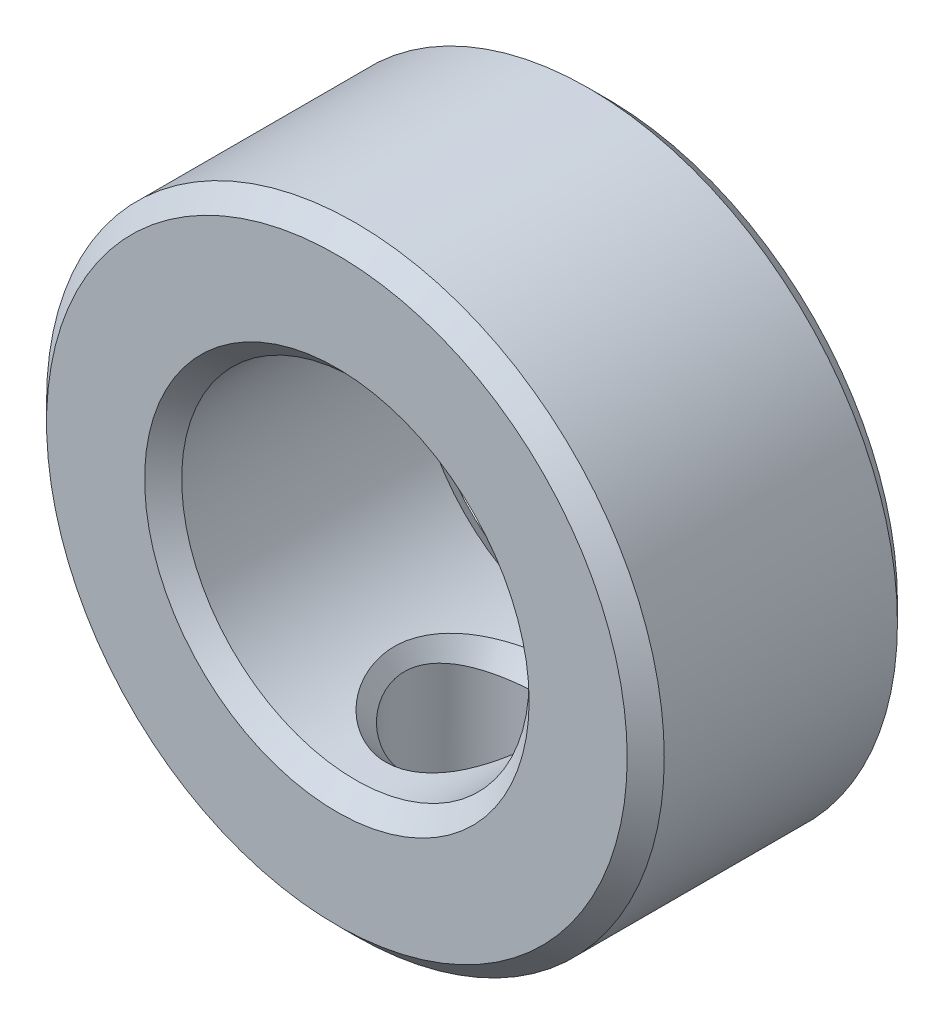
ISO-10303-21;
HEADER;
FILE_DESCRIPTION(('STEP AP214'),'2;1');
FILE_NAME('part.step','',(''),(''),'','','');
FILE_SCHEMA(('AUTOMOTIVE_DESIGN { 1 0 10303 214 1 1 1 1 }'));
ENDSEC;
DATA;
#1=APPLICATION_CONTEXT('core data for automotive mechanical design processes');
#2=APPLICATION_PROTOCOL_DEFINITION('international standard','automotive_design',2000,#1);
#3=PRODUCT_CONTEXT('',#1,'mechanical');
#4=PRODUCT('Part','Part','',(#3));
#5=PRODUCT_RELATED_PRODUCT_CATEGORY('part','',(#4));
#6=PRODUCT_DEFINITION_FORMATION('','',#4);
#7=PRODUCT_DEFINITION_CONTEXT('part definition',#1,'design');
#8=PRODUCT_DEFINITION('design','',#6,#7);
#9=PRODUCT_DEFINITION_SHAPE('','',#8);
#10=(LENGTH_UNIT() NAMED_UNIT(*) SI_UNIT(.MILLI.,.METRE.));
#11=(NAMED_UNIT(*) PLANE_ANGLE_UNIT() SI_UNIT($,.RADIAN.));
#12=(NAMED_UNIT(*) SI_UNIT($,.STERADIAN.) SOLID_ANGLE_UNIT());
#13=UNCERTAINTY_MEASURE_WITH_UNIT(LENGTH_MEASURE(1.E-05),#10,'distance_accuracy_value','');
#14=(GEOMETRIC_REPRESENTATION_CONTEXT(3) GLOBAL_UNCERTAINTY_ASSIGNED_CONTEXT((#13)) GLOBAL_UNIT_ASSIGNED_CONTEXT((#10,
#11,#12)) REPRESENTATION_CONTEXT('',''));
#15=CARTESIAN_POINT('',(0.,0.,0.));
#16=DIRECTION('',(0.,0.,1.));
#17=DIRECTION('',(1.,0.,0.));
#18=AXIS2_PLACEMENT_3D('',#15,#16,#17);
#19=CARTESIAN_POINT('',(0.,0.,5.55625));
#20=DIRECTION('',(0.,0.,1.));
#21=DIRECTION('',(1.,0.,0.));
#22=AXIS2_PLACEMENT_3D('',#19,#20,#21);
#23=PLANE('',#22);
#24=CARTESIAN_POINT('',(0.,0.,5.55625));
#25=DIRECTION('',(0.,0.,1.));
#26=DIRECTION('',(1.,0.,0.));
#27=AXIS2_PLACEMENT_3D('',#24,#25,#26);
#28=CIRCLE('',#27,7.90575);
#29=CARTESIAN_POINT('',(7.90575,0.,5.55625));
#30=VERTEX_POINT('',#29);
#31=EDGE_CURVE('E65',#30,#30,#28,.F.);
#32=ORIENTED_EDGE('',*,*,#31,.T.);
#33=EDGE_LOOP('',(#32));
#34=FACE_BOUND('',#33,.T.);
#35=CARTESIAN_POINT('',(0.,0.,5.55625));
#36=DIRECTION('',(0.,0.,1.));
#37=DIRECTION('',(1.,0.,0.));
#38=AXIS2_PLACEMENT_3D('',#35,#36,#37);
#39=CIRCLE('',#38,11.938);
#40=CARTESIAN_POINT('',(11.938,0.,5.55625));
#41=VERTEX_POINT('',#40);
#42=EDGE_CURVE('E135',#41,#41,#39,.T.);
#43=ORIENTED_EDGE('',*,*,#42,.T.);
#44=EDGE_LOOP('',(#43));
#45=FACE_BOUND('',#44,.T.);
#46=ADVANCED_FACE('F30',(#34,#45),#23,.T.);
#47=CARTESIAN_POINT('',(0.,0.,-5.55625));
#48=DIRECTION('',(0.,0.,1.));
#49=DIRECTION('',(1.,0.,0.));
#50=AXIS2_PLACEMENT_3D('',#47,#48,#49);
#51=PLANE('',#50);
#52=CARTESIAN_POINT('',(0.,0.,-5.55625));
#53=DIRECTION('',(0.,0.,1.));
#54=DIRECTION('',(1.,0.,0.));
#55=AXIS2_PLACEMENT_3D('',#52,#53,#54);
#56=CIRCLE('',#55,7.90575);
#57=CARTESIAN_POINT('',(7.90575,0.,-5.55625));
#58=VERTEX_POINT('',#57);
#59=EDGE_CURVE('E145',#58,#58,#56,.T.);
#60=ORIENTED_EDGE('',*,*,#59,.T.);
#61=EDGE_LOOP('',(#60));
#62=FACE_BOUND('',#61,.T.);
#63=CARTESIAN_POINT('',(0.,0.,-5.55625));
#64=DIRECTION('',(0.,0.,1.));
#65=DIRECTION('',(1.,0.,0.));
#66=AXIS2_PLACEMENT_3D('',#63,#64,#65);
#67=CIRCLE('',#66,11.938);
#68=CARTESIAN_POINT('',(11.938,0.,-5.55625));
#69=VERTEX_POINT('',#68);
#70=EDGE_CURVE('E148',#69,#69,#67,.F.);
#71=ORIENTED_EDGE('',*,*,#70,.T.);
#72=EDGE_LOOP('',(#71));
#73=FACE_BOUND('',#72,.T.);
#74=ADVANCED_FACE('F123',(#62,#73),#51,.F.);
#75=CARTESIAN_POINT('',(0.,0.,5.55625));
#76=DIRECTION('',(0.,0.,-1.));
#77=DIRECTION('',(-1.,0.,0.));
#78=AXIS2_PLACEMENT_3D('',#75,#76,#77);
#79=CYLINDRICAL_SURFACE('',#78,12.7);
#80=CARTESIAN_POINT('',(0.,-12.7,3.54012493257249));
#81=CARTESIAN_POINT('',(-0.0620983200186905,-12.7000092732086,3.54015884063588));
#82=CARTESIAN_POINT('',(-0.124194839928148,-12.6995073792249,3.5386876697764));
#83=CARTESIAN_POINT('',(-0.248096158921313,-12.6975321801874,3.53278375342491));
#84=CARTESIAN_POINT('',(-0.309901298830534,-12.6960609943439,3.52835746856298));
#85=CARTESIAN_POINT('',(-0.433091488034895,-12.6922012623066,3.51660238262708));
#86=CARTESIAN_POINT('',(-0.494477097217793,-12.6898143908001,3.50927887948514));
#87=CARTESIAN_POINT('',(-0.61670189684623,-12.6841777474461,3.4917893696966));
#88=CARTESIAN_POINT('',(-0.677541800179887,-12.6809293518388,3.4816278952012));
#89=CARTESIAN_POINT('',(-0.798548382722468,-12.6736238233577,3.45852168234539));
#90=CARTESIAN_POINT('',(-0.858715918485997,-12.6695678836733,3.44558104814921));
#91=CARTESIAN_POINT('',(-0.978251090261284,-12.66070136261,3.41697552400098));
#92=CARTESIAN_POINT('',(-1.03761975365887,-12.6558918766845,3.40131458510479));
#93=CARTESIAN_POINT('',(-1.15543042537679,-12.6455722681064,3.36732716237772));
#94=CARTESIAN_POINT('',(-1.21387368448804,-12.6400632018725,3.34900469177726));
#95=CARTESIAN_POINT('',(-1.32970673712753,-12.6283983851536,3.30975271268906));
#96=CARTESIAN_POINT('',(-1.38709807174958,-12.6222436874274,3.28882743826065));
#97=CARTESIAN_POINT('',(-1.50070038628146,-12.6093415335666,3.2444282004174));
#98=CARTESIAN_POINT('',(-1.55691326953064,-12.6025951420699,3.22095879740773));
#99=CARTESIAN_POINT('',(-1.66803171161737,-12.5885634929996,3.17152955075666));
#100=CARTESIAN_POINT('',(-1.72293960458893,-12.5812793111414,3.14557464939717));
#101=CARTESIAN_POINT('',(-1.83132103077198,-12.5662260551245,3.09123259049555));
#102=CARTESIAN_POINT('',(-1.8847973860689,-12.5584580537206,3.06285076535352));
#103=CARTESIAN_POINT('',(-1.99018861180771,-12.5424908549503,3.00371306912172));
#104=CARTESIAN_POINT('',(-2.042106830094,-12.5342927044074,2.97296288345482));
#105=CARTESIAN_POINT('',(-2.1442547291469,-12.5175200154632,2.90914658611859));
#106=CARTESIAN_POINT('',(-2.19448829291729,-12.5089464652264,2.87608643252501));
#107=CARTESIAN_POINT('',(-2.29313940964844,-12.491473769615,2.80770886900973));
#108=CARTESIAN_POINT('',(-2.34156135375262,-12.4825755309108,2.77239756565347));
#109=CARTESIAN_POINT('',(-2.43646332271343,-12.4645193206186,2.69957474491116));
#110=CARTESIAN_POINT('',(-2.48294816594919,-12.4553621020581,2.66206932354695));
#111=CARTESIAN_POINT('',(-2.57384440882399,-12.4367979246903,2.58492197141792));
#112=CARTESIAN_POINT('',(-2.61826093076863,-12.4273916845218,2.54528590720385));
#113=CARTESIAN_POINT('',(-2.70489331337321,-12.408550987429,2.4639329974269));
#114=CARTESIAN_POINT('',(-2.74711514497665,-12.3991166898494,2.42222247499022));
#115=CARTESIAN_POINT('',(-2.82929226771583,-12.3804489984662,2.33683743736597));
#116=CARTESIAN_POINT('',(-2.8692541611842,-12.3712150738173,2.29316939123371));
#117=CARTESIAN_POINT('',(-2.94684354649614,-12.3529652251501,2.20399539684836));
#118=CARTESIAN_POINT('',(-2.9844775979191,-12.3439487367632,2.15849527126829));
#119=CARTESIAN_POINT('',(-3.05734897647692,-12.3262063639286,2.06577655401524));
#120=CARTESIAN_POINT('',(-3.09259288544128,-12.3174797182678,2.01856328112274));
#121=CARTESIAN_POINT('',(-3.16062006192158,-12.3003748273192,1.92253931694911));
#122=CARTESIAN_POINT('',(-3.19340999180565,-12.2919956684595,1.87373350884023));
#123=CARTESIAN_POINT('',(-3.25646563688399,-12.275647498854,1.77464499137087));
#124=CARTESIAN_POINT('',(-3.28673811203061,-12.2676774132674,1.72436676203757));
#125=CARTESIAN_POINT('',(-3.34469514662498,-12.252208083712,1.62245401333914));
#126=CARTESIAN_POINT('',(-3.37238653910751,-12.2447076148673,1.5708235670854));
#127=CARTESIAN_POINT('',(-3.42511775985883,-12.2302384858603,1.46632696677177));
#128=CARTESIAN_POINT('',(-3.45016441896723,-12.2232684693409,1.41346444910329));
#129=CARTESIAN_POINT('',(-3.49754259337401,-12.2099211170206,1.30662432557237));
#130=CARTESIAN_POINT('',(-3.51988080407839,-12.2035423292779,1.2526498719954));
#131=CARTESIAN_POINT('',(-3.56177863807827,-12.1914382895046,1.14370653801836));
#132=CARTESIAN_POINT('',(-3.58134462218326,-12.1857115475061,1.08874027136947));
#133=CARTESIAN_POINT('',(-3.61763476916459,-12.174972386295,0.977934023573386));
#134=CARTESIAN_POINT('',(-3.63436468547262,-12.1699585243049,0.922096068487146));
#135=CARTESIAN_POINT('',(-3.66491971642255,-12.1607058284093,0.809667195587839));
#136=CARTESIAN_POINT('',(-3.67874962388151,-12.1564657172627,0.753077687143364));
#137=CARTESIAN_POINT('',(-3.70344211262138,-12.1488210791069,0.639266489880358));
#138=CARTESIAN_POINT('',(-3.71430808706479,-12.145415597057,0.58204560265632));
#139=CARTESIAN_POINT('',(-3.733010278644,-12.1395007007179,0.467092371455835));
#140=CARTESIAN_POINT('',(-3.74084796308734,-12.1369908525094,0.409360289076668));
#141=CARTESIAN_POINT('',(-3.75343300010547,-12.1329271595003,0.293505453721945));
#142=CARTESIAN_POINT('',(-3.75817928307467,-12.1313736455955,0.235382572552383));
#143=CARTESIAN_POINT('',(-3.76451663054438,-12.1292835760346,0.118866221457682));
#144=CARTESIAN_POINT('',(-3.76610339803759,-12.1287484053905,0.060472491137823));
#145=CARTESIAN_POINT('',(-3.76607599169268,-12.1287509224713,-0.0563137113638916));
#146=CARTESIAN_POINT('',(-3.76446182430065,-12.1292886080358,-0.114706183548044));
#147=CARTESIAN_POINT('',(-3.75809651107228,-12.1313769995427,-0.23121945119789));
#148=CARTESIAN_POINT('',(-3.75334969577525,-12.1329263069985,-0.289340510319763));
#149=CARTESIAN_POINT('',(-3.74078040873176,-12.136977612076,-0.40519213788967));
#150=CARTESIAN_POINT('',(-3.73295911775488,-12.1394792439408,-0.462922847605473));
#151=CARTESIAN_POINT('',(-3.7143063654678,-12.1453739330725,-0.577874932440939));
#152=CARTESIAN_POINT('',(-3.70347358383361,-12.1487673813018,-0.635096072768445));
#153=CARTESIAN_POINT('',(-3.67886137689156,-12.1563850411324,-0.748910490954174));
#154=CARTESIAN_POINT('',(-3.66507871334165,-12.1606101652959,-0.805503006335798));
#155=CARTESIAN_POINT('',(-3.63463004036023,-12.1698306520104,-0.91794173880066));
#156=CARTESIAN_POINT('',(-3.61795937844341,-12.1748272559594,-0.973786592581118));
#157=CARTESIAN_POINT('',(-3.58179741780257,-12.1855303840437,-1.08461161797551));
#158=CARTESIAN_POINT('',(-3.56230047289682,-12.1912383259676,-1.13958980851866));
#159=CARTESIAN_POINT('',(-3.52054827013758,-12.2033039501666,-1.24856311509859));
#160=CARTESIAN_POINT('',(-3.49828671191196,-12.2096631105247,-1.30255565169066));
#161=CARTESIAN_POINT('',(-3.45106726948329,-12.2229710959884,-1.40943922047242));
#162=CARTESIAN_POINT('',(-3.42610269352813,-12.2299213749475,-1.46232711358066));
#163=CARTESIAN_POINT('',(-3.37353895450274,-12.2443516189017,-1.56688291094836));
#164=CARTESIAN_POINT('',(-3.3459329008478,-12.2518329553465,-1.61854716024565));
#165=CARTESIAN_POINT('',(-3.28814774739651,-12.2672653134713,-1.72053713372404));
#166=CARTESIAN_POINT('',(-3.25796168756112,-12.2752175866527,-1.77085872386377));
#167=CARTESIAN_POINT('',(-3.19507798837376,-12.2915321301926,-1.87004478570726));
#168=CARTESIAN_POINT('',(-3.16237339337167,-12.2998955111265,-1.91890466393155));
#169=CARTESIAN_POINT('',(-3.09451383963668,-12.3169715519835,-2.0150487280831));
#170=CARTESIAN_POINT('',(-3.05935195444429,-12.3256851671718,-2.06232785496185));
#171=CARTESIAN_POINT('',(-2.98663969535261,-12.3434048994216,-2.15519167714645));
#172=CARTESIAN_POINT('',(-2.94908241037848,-12.3524118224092,-2.20077080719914));
#173=CARTESIAN_POINT('',(-2.87163868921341,-12.3706466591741,-2.29011656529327));
#174=CARTESIAN_POINT('',(-2.83174529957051,-12.3798751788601,-2.33387704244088));
#175=CARTESIAN_POINT('',(-2.7496983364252,-12.3985369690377,-2.41946514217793));
#176=CARTESIAN_POINT('',(-2.70753772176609,-12.4079708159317,-2.46128589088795));
#177=CARTESIAN_POINT('',(-2.62101284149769,-12.4268146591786,-2.54286109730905));
#178=CARTESIAN_POINT('',(-2.5766423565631,-12.4362244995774,-2.5826089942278));
#179=CARTESIAN_POINT('',(-2.485819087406,-12.4547980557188,-2.6599647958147));
#180=CARTESIAN_POINT('',(-2.43936113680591,-12.4639610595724,-2.6975668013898));
#181=CARTESIAN_POINT('',(-2.3444991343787,-12.4820308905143,-2.7705720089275));
#182=CARTESIAN_POINT('',(-2.29609021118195,-12.490936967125,-2.80596906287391));
#183=CARTESIAN_POINT('',(-2.19745269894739,-12.5084271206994,-2.87450754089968));
#184=CARTESIAN_POINT('',(-2.1472196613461,-12.5170102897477,-2.90764279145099));
#185=CARTESIAN_POINT('',(-2.04506278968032,-12.5338037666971,-2.9716000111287));
#186=CARTESIAN_POINT('',(-1.99313502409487,-12.5420130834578,-3.00241595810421));
#187=CARTESIAN_POINT('',(-1.88771680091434,-12.5580039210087,-3.06167689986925));
#188=CARTESIAN_POINT('',(-1.83422296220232,-12.5657843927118,-3.09011616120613));
#189=CARTESIAN_POINT('',(-1.72580085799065,-12.5808636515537,-3.14456587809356));
#190=CARTESIAN_POINT('',(-1.67086975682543,-12.5881613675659,-3.17057098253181));
#191=CARTESIAN_POINT('',(-1.55970135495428,-12.602220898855,-3.22009444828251));
#192=CARTESIAN_POINT('',(-1.50346172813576,-12.6089816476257,-3.24360789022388));
#193=CARTESIAN_POINT('',(-1.38980455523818,-12.6219130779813,-3.2880900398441));
#194=CARTESIAN_POINT('',(-1.33238513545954,-12.6280827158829,-3.30905426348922));
#195=CARTESIAN_POINT('',(-1.21649671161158,-12.6397777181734,-3.34837998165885));
#196=CARTESIAN_POINT('',(-1.15802621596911,-12.6453020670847,-3.36673738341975));
#197=CARTESIAN_POINT('',(-1.04016404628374,-12.6556522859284,-3.40079150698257));
#198=CARTESIAN_POINT('',(-0.980771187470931,-12.6604771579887,-3.41648443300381));
#199=CARTESIAN_POINT('',(-0.861192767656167,-12.6693742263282,-3.44515174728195));
#200=CARTESIAN_POINT('',(-0.80100625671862,-12.6734454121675,-3.45812248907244));
#201=CARTESIAN_POINT('',(-0.679969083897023,-12.6807809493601,-3.48128773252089));
#202=CARTESIAN_POINT('',(-0.619117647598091,-12.6840442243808,-3.49147853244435));
#203=CARTESIAN_POINT('',(-0.496879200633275,-12.6897098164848,-3.50902637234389));
#204=CARTESIAN_POINT('',(-0.435491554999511,-12.6921109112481,-3.51637939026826));
#205=CARTESIAN_POINT('',(-0.312309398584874,-12.6959981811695,-3.5281945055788));
#206=CARTESIAN_POINT('',(-0.250514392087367,-12.6974828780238,-3.53265193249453));
#207=CARTESIAN_POINT('',(-0.126645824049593,-12.699483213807,-3.53861869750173));
#208=CARTESIAN_POINT('',(-0.0645719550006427,-12.6999969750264,-3.54012232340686));
#209=CARTESIAN_POINT('',(0.0595840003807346,-12.7000025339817,-3.54012598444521));
#210=CARTESIAN_POINT('',(0.121666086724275,-12.6994941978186,-3.53862562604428));
#211=CARTESIAN_POINT('',(0.245566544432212,-12.6975064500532,-3.53266852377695));
#212=CARTESIAN_POINT('',(0.307385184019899,-12.6960286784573,-3.52821677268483));
#213=CARTESIAN_POINT('',(0.430628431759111,-12.6921563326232,-3.51641601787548));
#214=CARTESIAN_POINT('',(0.492053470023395,-12.6897630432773,-3.50907107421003));
#215=CARTESIAN_POINT('',(0.614378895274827,-12.684114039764,-3.4915429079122));
#216=CARTESIAN_POINT('',(0.675279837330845,-12.6808593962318,-3.48136320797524));
#217=CARTESIAN_POINT('',(0.796426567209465,-12.6735418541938,-3.45822403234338));
#218=CARTESIAN_POINT('',(0.856673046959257,-12.6694799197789,-3.44526787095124));
#219=CARTESIAN_POINT('',(0.976380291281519,-12.6606018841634,-3.41663397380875));
#220=CARTESIAN_POINT('',(1.03584193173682,-12.6557867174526,-3.40095960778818));
#221=CARTESIAN_POINT('',(1.15384888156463,-12.645456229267,-3.36694723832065));
#222=CARTESIAN_POINT('',(1.21239532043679,-12.6399418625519,-3.34861286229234));
#223=CARTESIAN_POINT('',(1.3284411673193,-12.6282669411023,-3.30933821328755));
#224=CARTESIAN_POINT('',(1.38594204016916,-12.6221073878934,-3.28840197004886));
#225=CARTESIAN_POINT('',(1.49976596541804,-12.6091960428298,-3.24398118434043));
#226=CARTESIAN_POINT('',(1.55609090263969,-12.6024453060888,-3.22050116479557));
#227=CARTESIAN_POINT('',(1.66743207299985,-12.5884055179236,-3.17105033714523));
#228=CARTESIAN_POINT('',(1.72245069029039,-12.581117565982,-3.14508458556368));
#229=CARTESIAN_POINT('',(1.83104826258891,-12.5660573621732,-3.09071975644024));
#230=CARTESIAN_POINT('',(1.88463016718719,-12.5582862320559,-3.06232626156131));
#231=CARTESIAN_POINT('',(1.99022325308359,-12.5423134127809,-3.00316344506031));
#232=CARTESIAN_POINT('',(2.04223799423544,-12.5341128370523,-2.97240017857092));
#233=CARTESIAN_POINT('',(2.14456577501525,-12.5173360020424,-2.90855525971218));
#234=CARTESIAN_POINT('',(2.19488299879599,-12.5087608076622,-2.87548003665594));
#235=CARTESIAN_POINT('',(2.29368427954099,-12.4912855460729,-2.80706915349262));
#236=CARTESIAN_POINT('',(2.34217311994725,-12.4823864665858,-2.77174015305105));
#237=CARTESIAN_POINT('',(2.43718796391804,-12.4643295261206,-2.69887827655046));
#238=CARTESIAN_POINT('',(2.48371926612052,-12.4551724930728,-2.66135210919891));
#239=CARTESIAN_POINT('',(2.57468289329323,-12.4366091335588,-2.58415832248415));
#240=CARTESIAN_POINT('',(2.61912090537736,-12.4272036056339,-2.54449721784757));
#241=CARTESIAN_POINT('',(2.70577510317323,-12.4083656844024,-2.46308565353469));
#242=CARTESIAN_POINT('',(2.74799760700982,-12.3989334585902,-2.42134188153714));
#243=CARTESIAN_POINT('',(2.83016525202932,-12.3802718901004,-2.33588182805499));
#244=CARTESIAN_POINT('',(2.87011702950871,-12.3710420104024,-2.29217204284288));
#245=CARTESIAN_POINT('',(2.94767658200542,-12.3528013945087,-2.20290758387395));
#246=CARTESIAN_POINT('',(2.98529091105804,-12.3437900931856,-2.15735871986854));
#247=CARTESIAN_POINT('',(3.05811532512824,-12.3260590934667,-2.06453784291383));
#248=CARTESIAN_POINT('',(3.09333195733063,-12.3173386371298,-2.01727111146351));
#249=CARTESIAN_POINT('',(3.16129889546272,-12.3002467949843,-1.92113762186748));
#250=CARTESIAN_POINT('',(3.1940558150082,-12.2918745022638,-1.87227570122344));
#251=CARTESIAN_POINT('',(3.25704163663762,-12.2755404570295,-1.77307446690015));
#252=CARTESIAN_POINT('',(3.28727725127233,-12.2675776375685,-1.72273959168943));
#253=CARTESIAN_POINT('',(3.34515861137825,-12.2521229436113,-1.62071514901));
#254=CARTESIAN_POINT('',(3.37281116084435,-12.2446298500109,-1.56902962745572));
#255=CARTESIAN_POINT('',(3.4254645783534,-12.2301752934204,-1.46442655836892));
#256=CARTESIAN_POINT('',(3.45047228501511,-12.2232124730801,-1.41151264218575));
#257=CARTESIAN_POINT('',(3.49777425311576,-12.2098790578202,-1.3045754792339));
#258=CARTESIAN_POINT('',(3.52007527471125,-12.2035069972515,-1.25055540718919));
#259=CARTESIAN_POINT('',(3.56190222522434,-12.1914156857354,-1.14152866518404));
#260=CARTESIAN_POINT('',(3.58143465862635,-12.1856949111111,-1.08652466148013));
#261=CARTESIAN_POINT('',(3.61766296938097,-12.174966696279,-0.975652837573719));
#262=CARTESIAN_POINT('',(3.63436484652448,-12.1699577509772,-0.919787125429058));
#263=CARTESIAN_POINT('',(3.6648708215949,-12.1607136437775,-0.807314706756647));
#264=CARTESIAN_POINT('',(3.67868008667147,-12.1564771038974,-0.750709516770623));
#265=CARTESIAN_POINT('',(3.70334000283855,-12.1488381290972,-0.636880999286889));
#266=CARTESIAN_POINT('',(3.71419457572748,-12.1454345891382,-0.579658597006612));
#267=CARTESIAN_POINT('',(3.7328844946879,-12.1395218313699,-0.464718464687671));
#268=CARTESIAN_POINT('',(3.74072201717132,-12.1370119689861,-0.407001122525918));
#269=CARTESIAN_POINT('',(3.75331847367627,-12.1329464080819,-0.291193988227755));
#270=CARTESIAN_POINT('',(3.75807725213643,-12.1313907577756,-0.233104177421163));
#271=CARTESIAN_POINT('',(3.76445468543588,-12.1292938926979,-0.116674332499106));
#272=CARTESIAN_POINT('',(3.7660701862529,-12.1287536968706,-0.0583341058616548));
#273=CARTESIAN_POINT('',(3.76611049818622,-12.1287452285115,0.0583342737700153));
#274=CARTESIAN_POINT('',(3.76453602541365,-12.1292767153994,0.116662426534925));
#275=CARTESIAN_POINT('',(3.7582534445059,-12.1313532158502,0.233046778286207));
#276=CARTESIAN_POINT('',(3.7535498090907,-12.1328967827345,0.291103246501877));
#277=CARTESIAN_POINT('',(3.74107035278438,-12.1369366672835,0.406825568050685));
#278=CARTESIAN_POINT('',(3.73329584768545,-12.1394325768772,0.464491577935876));
#279=CARTESIAN_POINT('',(3.71473811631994,-12.1453160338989,0.579314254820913));
#280=CARTESIAN_POINT('',(3.70395368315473,-12.1487039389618,0.636470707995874));
#281=CARTESIAN_POINT('',(3.67943819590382,-12.1563107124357,0.750155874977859));
#282=CARTESIAN_POINT('',(3.66570398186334,-12.1605304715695,0.806683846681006));
#283=CARTESIAN_POINT('',(3.635350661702,-12.1697404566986,0.918993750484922));
#284=CARTESIAN_POINT('',(3.61872693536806,-12.1747319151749,0.974774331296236));
#285=CARTESIAN_POINT('',(3.58265578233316,-12.1854249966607,1.08547121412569));
#286=CARTESIAN_POINT('',(3.56320268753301,-12.1911280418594,1.14038553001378));
#287=CARTESIAN_POINT('',(3.52153360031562,-12.2031841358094,1.24923164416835));
#288=CARTESIAN_POINT('',(3.49931122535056,-12.2095386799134,1.30316083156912));
#289=CARTESIAN_POINT('',(3.45216405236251,-12.2228377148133,1.4099184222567));
#290=CARTESIAN_POINT('',(3.42723241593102,-12.2297836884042,1.46274361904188));
#291=CARTESIAN_POINT('',(3.37472694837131,-12.24420562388,1.56717491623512));
#292=CARTESIAN_POINT('',(3.34714601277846,-12.251682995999,1.61877724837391));
#293=CARTESIAN_POINT('',(3.28940198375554,-12.2671077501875,1.72064446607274));
#294=CARTESIAN_POINT('',(3.25923164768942,-12.2750564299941,1.77090504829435));
#295=CARTESIAN_POINT('',(3.19636876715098,-12.2913641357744,1.86997035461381));
#296=CARTESIAN_POINT('',(3.16366891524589,-12.2997243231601,1.91877024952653));
#297=CARTESIAN_POINT('',(3.09580675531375,-12.3167943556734,2.01479585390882));
#298=CARTESIAN_POINT('',(3.06063710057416,-12.3255052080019,2.0620161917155));
#299=CARTESIAN_POINT('',(2.9878955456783,-12.3432198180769,2.15476399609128));
#300=CARTESIAN_POINT('',(2.95031624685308,-12.352224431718,2.20028549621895));
#301=CARTESIAN_POINT('',(2.87281382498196,-12.3704551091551,2.28951838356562));
#302=CARTESIAN_POINT('',(2.8328831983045,-12.3796818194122,2.33322312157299));
#303=CARTESIAN_POINT('',(2.7507433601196,-12.3983404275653,2.41870010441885));
#304=CARTESIAN_POINT('',(2.7085264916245,-12.407772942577,2.4604648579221));
#305=CARTESIAN_POINT('',(2.62187752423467,-12.4266147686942,2.54193721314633));
#306=CARTESIAN_POINT('',(2.57743855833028,-12.4360238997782,2.58163755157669));
#307=CARTESIAN_POINT('',(2.48647483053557,-12.4545971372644,2.65891577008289));
#308=CARTESIAN_POINT('',(2.43994435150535,-12.4637604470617,2.69648710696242));
#309=CARTESIAN_POINT('',(2.34493261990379,-12.4818318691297,2.76944470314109));
#310=CARTESIAN_POINT('',(2.29644606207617,-12.4907391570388,2.80482425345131));
#311=CARTESIAN_POINT('',(2.19765019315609,-12.5082326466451,2.87334060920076));
#312=CARTESIAN_POINT('',(2.1473361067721,-12.5168178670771,2.90647077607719));
#313=CARTESIAN_POINT('',(2.0450149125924,-12.5336162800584,2.97042906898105));
#314=CARTESIAN_POINT('',(1.99300363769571,-12.5418284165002,3.00125080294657));
#315=CARTESIAN_POINT('',(1.88741724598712,-12.5578256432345,3.06053312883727));
#316=CARTESIAN_POINT('',(1.83383859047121,-12.5656096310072,3.08898771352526));
#317=CARTESIAN_POINT('',(1.72524673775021,-12.5806965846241,3.14347639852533));
#318=CARTESIAN_POINT('',(1.67023061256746,-12.5879984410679,3.16950496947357));
#319=CARTESIAN_POINT('',(1.55889310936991,-12.6020668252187,3.21908221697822));
#320=CARTESIAN_POINT('',(1.50256936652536,-12.6088322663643,3.24262589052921));
#321=CARTESIAN_POINT('',(1.38874597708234,-12.6217735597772,3.28717387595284));
#322=CARTESIAN_POINT('',(1.33124446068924,-12.6279483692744,3.30817371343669));
#323=CARTESIAN_POINT('',(1.21519494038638,-12.6396540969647,3.34757455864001));
#324=CARTESIAN_POINT('',(1.15664548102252,-12.6451840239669,3.36597157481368));
#325=CARTESIAN_POINT('',(1.03862956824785,-12.6555456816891,3.40010735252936));
#326=CARTESIAN_POINT('',(0.979161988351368,-12.6603764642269,3.41584250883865));
#327=CARTESIAN_POINT('',(0.859439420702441,-12.6692855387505,3.4445952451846));
#328=CARTESIAN_POINT('',(0.799183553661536,-12.6733628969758,3.45760945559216));
#329=CARTESIAN_POINT('',(0.678014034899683,-12.6807108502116,3.48086110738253));
#330=CARTESIAN_POINT('',(0.617099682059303,-12.6839804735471,3.49109520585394));
#331=CARTESIAN_POINT('',(0.494743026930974,-12.6896587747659,3.50872773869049));
#332=CARTESIAN_POINT('',(0.433300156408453,-12.6920663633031,3.51612258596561));
#333=CARTESIAN_POINT('',(0.310015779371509,-12.6959663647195,3.52801767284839));
#334=CARTESIAN_POINT('',(0.24817382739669,-12.6974574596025,3.53251374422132));
#335=CARTESIAN_POINT('',(0.12422269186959,-12.6994708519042,3.53855388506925));
#336=CARTESIAN_POINT('',(0.0621132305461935,-12.69999145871,3.54009280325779));
#337=CARTESIAN_POINT('',(0.,-12.7,3.54012493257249));
#338=B_SPLINE_CURVE_WITH_KNOTS('',3,(#80,#81,#82,#83,#84,#85,#86,#87,#88,#89,#90,#91,#92,#93,
#94,#95,#96,#97,#98,#99,#100,#101,#102,#103,#104,#105,#106,#107,#108,#109,#110,#111,#112,#113,
#114,#115,#116,#117,#118,#119,#120,#121,#122,#123,#124,#125,#126,#127,#128,#129,#130,#131,#132,
#133,#134,#135,#136,#137,#138,#139,#140,#141,#142,#143,#144,#145,#146,#147,#148,#149,#150,#151,
#152,#153,#154,#155,#156,#157,#158,#159,#160,#161,#162,#163,#164,#165,#166,#167,#168,#169,#170,
#171,#172,#173,#174,#175,#176,#177,#178,#179,#180,#181,#182,#183,#184,#185,#186,#187,#188,#189,
#190,#191,#192,#193,#194,#195,#196,#197,#198,#199,#200,#201,#202,#203,#204,#205,#206,#207,#208,
#209,#210,#211,#212,#213,#214,#215,#216,#217,#218,#219,#220,#221,#222,#223,#224,#225,#226,#227,
#228,#229,#230,#231,#232,#233,#234,#235,#236,#237,#238,#239,#240,#241,#242,#243,#244,#245,#246,
#247,#248,#249,#250,#251,#252,#253,#254,#255,#256,#257,#258,#259,#260,#261,#262,#263,#264,#265,
#266,#267,#268,#269,#270,#271,#272,#273,#274,#275,#276,#277,#278,#279,#280,#281,#282,#283,#284,
#285,#286,#287,#288,#289,#290,#291,#292,#293,#294,#295,#296,#297,#298,#299,#300,#301,#302,#303,
#304,#305,#306,#307,#308,#309,#310,#311,#312,#313,#314,#315,#316,#317,#318,#319,#320,#321,#322,
#323,#324,#325,#326,#327,#328,#329,#330,#331,#332,#333,#334,#335,#336,#337),.UNSPECIFIED.,.F.,
.F.,(4,2,2,2,2,2,2,2,2,2,2,2,2,2,2,2,2,2,2,2,2,2,2,2,2,2,2,2,2,2,2,2,2,2,2,2,2,2,2,2,2,2,2,2,2,
2,2,2,2,2,2,2,2,2,2,2,2,2,2,2,2,2,2,2,2,2,2,2,2,2,2,2,2,2,2,2,2,2,2,2,2,2,2,2,2,2,2,2,2,2,2,2,2,
2,2,2,2,2,2,2,2,2,2,2,2,2,2,2,2,2,2,2,2,2,2,2,2,2,2,2,2,2,2,2,2,2,2,2,4),(0.,0.18627076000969,
0.372135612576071,0.557662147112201,0.742894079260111,0.927854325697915,1.1125481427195,
1.29696630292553,1.48108829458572,1.66488553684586,1.8483246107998,2.03137051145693,
2.21398992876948,2.39615456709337,2.57784451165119,2.75905164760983,2.93978313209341,
3.11999397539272,3.29964779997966,3.4787698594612,3.65737675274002,3.83547968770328,
4.01308779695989,4.19021150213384,4.36686592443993,4.54307433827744,4.71887166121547,
4.89430796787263,5.06945200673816,5.24439468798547,5.41925249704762,5.59417077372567,
5.76932678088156,5.94448243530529,6.11939646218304,6.29424337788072,6.46916707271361,
6.64428378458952,6.81968527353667,6.99544212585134,7.17160713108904,7.34821868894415,
7.52530421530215,7.70288352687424,7.88097219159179,8.05958483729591,8.23873841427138,
8.41845540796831,8.59876699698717,8.77961839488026,8.96094512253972,9.14275668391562,
9.32504614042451,9.5077936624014,9.69097002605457,9.87454005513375,10.0584660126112,
10.2427109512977,10.4272420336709,10.6120338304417,10.7970716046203,10.9823545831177,
11.1678992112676,11.3537423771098,11.539944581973,11.7261711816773,11.9120835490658,
12.0977359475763,12.2831586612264,12.4683612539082,12.6533358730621,12.838060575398,
13.0225026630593,13.2066220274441,13.390374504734,13.5737152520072,13.7566021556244,
13.9389992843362,14.1208803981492,14.3022325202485,14.4830595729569,14.663339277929,
14.8430617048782,15.022255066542,15.2009376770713,15.3791212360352,15.5568141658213,
15.734024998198,15.9107658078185,16.0870556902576,16.2629242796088,16.438415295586,
16.6135901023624,16.7885312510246,16.9633459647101,17.1381695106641,17.3131683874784,
17.4881279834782,17.6628380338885,17.8374733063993,18.0121787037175,18.1870721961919,
18.3622479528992,18.5377796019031,18.713723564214,18.8901224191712,19.0670082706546,
19.2444060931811,19.4223370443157,19.6008217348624,19.7798834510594,19.9595513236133,
20.1398634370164,20.3207721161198,20.5022095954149,20.6841774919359,20.8666609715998,
21.0496323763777,21.2330547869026,21.4168855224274,21.6010795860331,21.7855930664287,
21.9703865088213,22.1554282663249,22.3406978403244,22.5261892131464,22.711914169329,
22.8979055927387,23.0842207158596),.UNSPECIFIED.);
#339=CARTESIAN_POINT('',(0.,-12.7,3.54012493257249));
#340=VERTEX_POINT('',#339);
#341=EDGE_CURVE('E50',#340,#340,#338,.F.);
#342=ORIENTED_EDGE('',*,*,#341,.T.);
#343=EDGE_LOOP('',(#342));
#344=FACE_BOUND('',#343,.T.);
#345=CARTESIAN_POINT('',(0.,0.,-4.79425));
#346=DIRECTION('',(0.,0.,1.));
#347=DIRECTION('',(1.,0.,0.));
#348=AXIS2_PLACEMENT_3D('',#345,#346,#347);
#349=CIRCLE('',#348,12.7);
#350=CARTESIAN_POINT('',(12.7,0.,-4.79425));
#351=VERTEX_POINT('',#350);
#352=EDGE_CURVE('E55',#351,#351,#349,.T.);
#353=ORIENTED_EDGE('',*,*,#352,.T.);
#354=EDGE_LOOP('',(#353));
#355=FACE_BOUND('',#354,.T.);
#356=CARTESIAN_POINT('',(0.,0.,4.79425));
#357=DIRECTION('',(0.,0.,1.));
#358=DIRECTION('',(1.,0.,0.));
#359=AXIS2_PLACEMENT_3D('',#356,#357,#358);
#360=CIRCLE('',#359,12.7);
#361=CARTESIAN_POINT('',(12.7,0.,4.79425));
#362=VERTEX_POINT('',#361);
#363=EDGE_CURVE('E60',#362,#362,#360,.F.);
#364=ORIENTED_EDGE('',*,*,#363,.T.);
#365=EDGE_LOOP('',(#364));
#366=FACE_BOUND('',#365,.T.);
#367=ADVANCED_FACE('F32',(#344,#355,#366),#79,.T.);
#368=CARTESIAN_POINT('',(0.,0.,5.55625));
#369=DIRECTION('',(0.,0.,-1.));
#370=DIRECTION('',(-1.,0.,0.));
#371=AXIS2_PLACEMENT_3D('',#368,#369,#370);
#372=CYLINDRICAL_SURFACE('',#371,7.14375);
#373=CARTESIAN_POINT('',(0.,-7.14375,3.54012503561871));
#374=CARTESIAN_POINT('',(0.853464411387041,-7.14368585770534,3.53989345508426));
#375=CARTESIAN_POINT('',(1.67960289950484,-6.97386022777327,3.14772620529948));
#376=CARTESIAN_POINT('',(2.84562211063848,-6.57807671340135,1.85734335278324));
#377=CARTESIAN_POINT('',(3.20026053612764,-6.38690908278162,0.943498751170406));
#378=CARTESIAN_POINT('',(3.19755510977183,-6.38809037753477,-0.946661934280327));
#379=CARTESIAN_POINT('',(2.84530828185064,-6.57818170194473,-1.8563968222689));
#380=CARTESIAN_POINT('',(1.67928641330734,-6.97396569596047,-3.14937058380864));
#381=CARTESIAN_POINT('',(0.85097122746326,-7.14402308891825,-3.54077883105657));
#382=CARTESIAN_POINT('',(-0.856899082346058,-7.14347568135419,-3.53946820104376));
#383=CARTESIAN_POINT('',(-1.68028677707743,-6.97371844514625,-3.1483134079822));
#384=CARTESIAN_POINT('',(-2.84524711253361,-6.5781153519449,-1.85641410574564));
#385=CARTESIAN_POINT('',(-3.19945550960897,-6.38718390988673,-0.940790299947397));
#386=CARTESIAN_POINT('',(-3.19835758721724,-6.38781682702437,0.947857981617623));
#387=CARTESIAN_POINT('',(-2.84645858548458,-6.57770993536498,1.85557171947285));
#388=CARTESIAN_POINT('',(-1.6817468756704,-6.97323141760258,3.14619542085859));
#389=CARTESIAN_POINT('',(-0.853464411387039,-7.14381414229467,3.54035661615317));
#390=CARTESIAN_POINT('',(0.,-7.14375,3.54012503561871));
#391=B_SPLINE_CURVE_WITH_KNOTS('',3,(#373,#374,#375,#376,#377,#378,#379,#380,#381,#382,#383,
#384,#385,#386,#387,#388,#389,#390),.UNSPECIFIED.,.T.,.F.,(4,2,2,2,2,2,2,2,4),
(-7.32565808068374E-05,0.00273225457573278,0.00553776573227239,0.008343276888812,
0.0111487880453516,0.0139542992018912,0.0167598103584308,0.0195653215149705,0.0223708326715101),.UNSPECIFIED.);
#392=CARTESIAN_POINT('',(0.,-7.14375,3.54012503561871));
#393=VERTEX_POINT('',#392);
#394=EDGE_CURVE('E10',#393,#393,#391,.F.);
#395=ORIENTED_EDGE('',*,*,#394,.T.);
#396=EDGE_LOOP('',(#395));
#397=FACE_BOUND('',#396,.T.);
#398=CARTESIAN_POINT('',(0.,0.,-4.79425));
#399=DIRECTION('',(0.,0.,1.));
#400=DIRECTION('',(1.,0.,0.));
#401=AXIS2_PLACEMENT_3D('',#398,#399,#400);
#402=CIRCLE('',#401,7.14375);
#403=CARTESIAN_POINT('',(7.14375,0.,-4.79425));
#404=VERTEX_POINT('',#403);
#405=EDGE_CURVE('E137',#404,#404,#402,.F.);
#406=ORIENTED_EDGE('',*,*,#405,.T.);
#407=EDGE_LOOP('',(#406));
#408=FACE_BOUND('',#407,.T.);
#409=CARTESIAN_POINT('',(0.,0.,4.79425));
#410=DIRECTION('',(0.,0.,1.));
#411=DIRECTION('',(1.,0.,0.));
#412=AXIS2_PLACEMENT_3D('',#409,#410,#411);
#413=CIRCLE('',#412,7.14375);
#414=CARTESIAN_POINT('',(7.14375,0.,4.79425));
#415=VERTEX_POINT('',#414);
#416=EDGE_CURVE('E140',#415,#415,#413,.T.);
#417=ORIENTED_EDGE('',*,*,#416,.T.);
#418=EDGE_LOOP('',(#417));
#419=FACE_BOUND('',#418,.T.);
#420=ADVANCED_FACE('F118',(#397,#408,#419),#372,.F.);
#421=CARTESIAN_POINT('',(0.,0.,-5.55625));
#422=DIRECTION('',(0.,0.,-1.));
#423=DIRECTION('',(-1.,0.,0.));
#424=AXIS2_PLACEMENT_3D('',#421,#422,#423);
#425=CONICAL_SURFACE('',#424,7.90575,0.785398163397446);
#426=ORIENTED_EDGE('',*,*,#405,.F.);
#427=EDGE_LOOP('',(#426));
#428=FACE_BOUND('',#427,.T.);
#429=ORIENTED_EDGE('',*,*,#59,.F.);
#430=EDGE_LOOP('',(#429));
#431=FACE_BOUND('',#430,.T.);
#432=ADVANCED_FACE('F115',(#428,#431),#425,.F.);
#433=CARTESIAN_POINT('',(0.,0.,4.79425));
#434=DIRECTION('',(0.,0.,1.));
#435=DIRECTION('',(1.,0.,0.));
#436=AXIS2_PLACEMENT_3D('',#433,#434,#435);
#437=CONICAL_SURFACE('',#436,7.14375,0.785398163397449);
#438=ORIENTED_EDGE('',*,*,#31,.F.);
#439=EDGE_LOOP('',(#438));
#440=FACE_BOUND('',#439,.T.);
#441=ORIENTED_EDGE('',*,*,#416,.F.);
#442=EDGE_LOOP('',(#441));
#443=FACE_BOUND('',#442,.T.);
#444=ADVANCED_FACE('F111',(#440,#443),#437,.F.);
#445=CARTESIAN_POINT('',(0.,0.,-4.79425));
#446=DIRECTION('',(0.,0.,1.));
#447=DIRECTION('',(1.,0.,0.));
#448=AXIS2_PLACEMENT_3D('',#445,#446,#447);
#449=CONICAL_SURFACE('',#448,12.7,0.785398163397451);
#450=ORIENTED_EDGE('',*,*,#70,.F.);
#451=EDGE_LOOP('',(#450));
#452=FACE_BOUND('',#451,.T.);
#453=ORIENTED_EDGE('',*,*,#352,.F.);
#454=EDGE_LOOP('',(#453));
#455=FACE_BOUND('',#454,.T.);
#456=ADVANCED_FACE('F107',(#452,#455),#449,.T.);
#457=CARTESIAN_POINT('',(0.,0.,5.55625));
#458=DIRECTION('',(0.,0.,-1.));
#459=DIRECTION('',(-1.,0.,0.));
#460=AXIS2_PLACEMENT_3D('',#457,#458,#459);
#461=CONICAL_SURFACE('',#460,11.938,0.785398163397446);
#462=ORIENTED_EDGE('',*,*,#363,.F.);
#463=EDGE_LOOP('',(#462));
#464=FACE_BOUND('',#463,.T.);
#465=ORIENTED_EDGE('',*,*,#42,.F.);
#466=EDGE_LOOP('',(#465));
#467=FACE_BOUND('',#466,.T.);
#468=ADVANCED_FACE('F92',(#464,#467),#461,.T.);
#469=CARTESIAN_POINT('',(0.,-25.4,0.));
#470=DIRECTION('',(0.,1.,0.));
#471=DIRECTION('',(0.,0.,1.));
#472=AXIS2_PLACEMENT_3D('',#469,#470,#471);
#473=CYLINDRICAL_SURFACE('',#472,2.778125);
#474=CARTESIAN_POINT('',(0.,-11.9380000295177,2.77812500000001));
#475=CARTESIAN_POINT('',(0.733828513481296,-11.9378663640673,2.77771078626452));
#476=CARTESIAN_POINT('',(1.45468460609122,-11.8144297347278,2.47432597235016));
#477=CARTESIAN_POINT('',(2.47749037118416,-11.5298655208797,1.4512203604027));
#478=CARTESIAN_POINT('',(2.77834142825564,-11.4009674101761,0.733175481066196));
#479=CARTESIAN_POINT('',(2.77790857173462,-11.4010816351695,-0.733165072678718));
#480=CARTESIAN_POINT('',(2.47542575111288,-11.5304622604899,-1.45370476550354));
#481=CARTESIAN_POINT('',(1.45267747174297,-11.814946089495,-2.4759159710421));
#482=CARTESIAN_POINT('',(0.731614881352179,-11.9380387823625,-2.77814469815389));
#483=CARTESIAN_POINT('',(-0.735300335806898,-11.9379608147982,-2.77810407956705));
#484=CARTESIAN_POINT('',(-1.45474729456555,-11.8146346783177,-2.47568918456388));
#485=CARTESIAN_POINT('',(-2.47605028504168,-11.5300372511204,-1.45123638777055));
#486=CARTESIAN_POINT('',(-2.77792373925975,-11.4010563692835,-0.732343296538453));
#487=CARTESIAN_POINT('',(-2.77832530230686,-11.400993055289,0.735606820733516));
#488=CARTESIAN_POINT('',(-2.47469291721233,-11.5306151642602,1.45469029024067));
#489=CARTESIAN_POINT('',(-1.45212075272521,-11.8151454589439,2.47621907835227));
#490=CARTESIAN_POINT('',(-0.733828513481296,-11.9381336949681,2.77853921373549));
#491=CARTESIAN_POINT('',(0.,-11.9380000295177,2.77812500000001));
#492=B_SPLINE_CURVE_WITH_KNOTS('',3,(#474,#475,#476,#477,#478,#479,#480,#481,#482,#483,#484,
#485,#486,#487,#488,#489,#490,#491),.UNSPECIFIED.,.T.,.F.,(4,2,2,2,2,2,2,2,4),
(0.000991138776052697,0.003771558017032,0.0065519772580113,0.0093323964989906,
0.0121128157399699,0.0148932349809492,0.0176736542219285,0.0204540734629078,0.0232344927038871),.UNSPECIFIED.);
#493=CARTESIAN_POINT('',(0.,-11.9380000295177,2.77812500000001));
#494=VERTEX_POINT('',#493);
#495=EDGE_CURVE('E41',#494,#494,#492,.F.);
#496=ORIENTED_EDGE('',*,*,#495,.T.);
#497=EDGE_LOOP('',(#496));
#498=FACE_BOUND('',#497,.T.);
#499=CARTESIAN_POINT('',(0.,-7.90575005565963,2.778125));
#500=CARTESIAN_POINT('',(-0.0462545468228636,-7.90575603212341,2.77813877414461));
#501=CARTESIAN_POINT('',(-0.0925050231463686,-7.90502351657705,2.77694248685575));
#502=CARTESIAN_POINT('',(-0.184740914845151,-7.90215767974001,2.77218175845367));
#503=CARTESIAN_POINT('',(-0.230726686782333,-7.90002738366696,2.7686224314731));
#504=CARTESIAN_POINT('',(-0.322336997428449,-7.89444400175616,2.75919137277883));
#505=CARTESIAN_POINT('',(-0.367961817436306,-7.89099207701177,2.75332167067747));
#506=CARTESIAN_POINT('',(-0.458757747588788,-7.88284513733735,2.73932839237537));
#507=CARTESIAN_POINT('',(-0.503928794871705,-7.87814995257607,2.73120450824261));
#508=CARTESIAN_POINT('',(-0.593724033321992,-7.86759505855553,2.71275968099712));
#509=CARTESIAN_POINT('',(-0.638347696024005,-7.86173430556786,2.70243676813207));
#510=CARTESIAN_POINT('',(-0.726955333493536,-7.84892656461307,2.67965028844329));
#511=CARTESIAN_POINT('',(-0.770938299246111,-7.84197803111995,2.66718367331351));
#512=CARTESIAN_POINT('',(-0.858171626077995,-7.82707262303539,2.64016555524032));
#513=CARTESIAN_POINT('',(-0.901420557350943,-7.81911399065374,2.62561041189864));
#514=CARTESIAN_POINT('',(-0.987092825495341,-7.80226601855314,2.59447055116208));
#515=CARTESIAN_POINT('',(-1.029514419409,-7.79337492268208,2.57788199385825));
#516=CARTESIAN_POINT('',(-1.11343888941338,-7.77473946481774,2.54273023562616));
#517=CARTESIAN_POINT('',(-1.15493984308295,-7.76499349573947,2.52416330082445));
#518=CARTESIAN_POINT('',(-1.23692975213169,-7.74472557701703,2.48510943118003));
#519=CARTESIAN_POINT('',(-1.27741674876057,-7.73420226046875,2.4646190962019));
#520=CARTESIAN_POINT('',(-1.35728533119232,-7.7124569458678,2.42177283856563));
#521=CARTESIAN_POINT('',(-1.39666506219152,-7.70123386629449,2.39941400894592));
#522=CARTESIAN_POINT('',(-1.47422545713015,-7.67816594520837,2.35288507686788));
#523=CARTESIAN_POINT('',(-1.51240449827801,-7.66632031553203,2.32871266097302));
#524=CARTESIAN_POINT('',(-1.58747007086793,-7.64208550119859,2.27861057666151));
#525=CARTESIAN_POINT('',(-1.62435532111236,-7.62969580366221,2.25267923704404));
#526=CARTESIAN_POINT('',(-1.69673844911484,-7.60444626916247,2.19911402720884));
#527=CARTESIAN_POINT('',(-1.73223547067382,-7.59158615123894,2.17147913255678));
#528=CARTESIAN_POINT('',(-1.80175206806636,-7.56548722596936,2.11455874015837));
#529=CARTESIAN_POINT('',(-1.83577126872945,-7.55224832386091,2.08527282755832));
#530=CARTESIAN_POINT('',(-1.90222388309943,-7.52541615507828,2.02511278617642));
#531=CARTESIAN_POINT('',(-1.93465741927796,-7.51182291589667,1.99423878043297));
#532=CARTESIAN_POINT('',(-1.99790778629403,-7.48455308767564,1.93091662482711));
#533=CARTESIAN_POINT('',(-2.02872471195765,-7.47087650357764,1.89846856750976));
#534=CARTESIAN_POINT('',(-2.08875514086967,-7.44373136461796,1.83204417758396));
#535=CARTESIAN_POINT('',(-2.11796877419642,-7.43026279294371,1.79806796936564));
#536=CARTESIAN_POINT('',(-2.17472643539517,-7.40357893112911,1.72868144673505));
#537=CARTESIAN_POINT('',(-2.20227122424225,-7.39036352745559,1.69327179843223));
#538=CARTESIAN_POINT('',(-2.25564326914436,-7.36429845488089,1.62110196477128));
#539=CARTESIAN_POINT('',(-2.28147197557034,-7.35144848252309,1.58434296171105));
#540=CARTESIAN_POINT('',(-2.3313589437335,-7.32620882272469,1.50956085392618));
#541=CARTESIAN_POINT('',(-2.35541937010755,-7.31381858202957,1.47153938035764));
#542=CARTESIAN_POINT('',(-2.40171816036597,-7.28959782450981,1.39431807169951));
#543=CARTESIAN_POINT('',(-2.42395937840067,-7.27776644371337,1.35512021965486));
#544=CARTESIAN_POINT('',(-2.46656780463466,-7.2547616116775,1.27563219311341));
#545=CARTESIAN_POINT('',(-2.48693848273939,-7.24358695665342,1.23534422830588));
#546=CARTESIAN_POINT('',(-2.5257540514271,-7.22199415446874,1.15376208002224));
#547=CARTESIAN_POINT('',(-2.54420289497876,-7.21157446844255,1.11247018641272));
#548=CARTESIAN_POINT('',(-2.57912312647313,-7.19159007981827,1.02896644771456));
#549=CARTESIAN_POINT('',(-2.59559875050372,-7.18202355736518,0.986756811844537));
#550=CARTESIAN_POINT('',(-2.62652108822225,-7.16384393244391,0.90150398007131));
#551=CARTESIAN_POINT('',(-2.64097204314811,-7.15522884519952,0.858462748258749));
#552=CARTESIAN_POINT('',(-2.6677938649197,-7.13905039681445,0.771633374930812));
#553=CARTESIAN_POINT('',(-2.68016861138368,-7.13148507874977,0.72784679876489));
#554=CARTESIAN_POINT('',(-2.70278723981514,-7.11750425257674,0.639613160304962));
#555=CARTESIAN_POINT('',(-2.7130341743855,-7.11108709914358,0.595167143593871));
#556=CARTESIAN_POINT('',(-2.73134679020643,-7.09950044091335,0.505702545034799));
#557=CARTESIAN_POINT('',(-2.73941412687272,-7.0943299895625,0.460684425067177));
#558=CARTESIAN_POINT('',(-2.75331807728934,-7.08533394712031,0.370158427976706));
#559=CARTESIAN_POINT('',(-2.75915427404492,-7.08150860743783,0.324650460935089));
#560=CARTESIAN_POINT('',(-2.76619533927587,-7.07685412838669,0.256123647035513));
#561=CARTESIAN_POINT('',(-2.76825742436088,-7.07548280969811,0.233225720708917));
#562=CARTESIAN_POINT('',(-2.7718055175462,-7.07311268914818,0.18734046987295));
#563=CARTESIAN_POINT('',(-2.77329090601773,-7.07211428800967,0.164353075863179));
#564=CARTESIAN_POINT('',(-2.7756789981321,-7.0705023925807,0.118300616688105));
#565=CARTESIAN_POINT('',(-2.77658083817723,-7.0698894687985,0.0952354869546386));
#566=CARTESIAN_POINT('',(-2.77779668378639,-7.0690599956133,0.04903809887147));
#567=CARTESIAN_POINT('',(-2.77810955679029,-7.06884420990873,0.0259057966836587));
#568=CARTESIAN_POINT('',(-2.77813767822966,-7.06882336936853,-0.0203648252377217));
#569=CARTESIAN_POINT('',(-2.77785278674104,-7.0690184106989,-0.0435031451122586));
#570=CARTESIAN_POINT('',(-2.77668616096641,-7.06981059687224,-0.0897239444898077));
#571=CARTESIAN_POINT('',(-2.77580529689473,-7.07040715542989,-0.112806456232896));
#572=CARTESIAN_POINT('',(-2.77345464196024,-7.07198914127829,-0.158904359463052));
#573=CARTESIAN_POINT('',(-2.77198545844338,-7.0729741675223,-0.181919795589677));
#574=CARTESIAN_POINT('',(-2.76846502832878,-7.0753205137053,-0.227871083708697));
#575=CARTESIAN_POINT('',(-2.76641415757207,-7.07668159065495,-0.250806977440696));
#576=CARTESIAN_POINT('',(-2.75939888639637,-7.08131031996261,-0.31947478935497));
#577=CARTESIAN_POINT('',(-2.75357085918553,-7.08512413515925,-0.365085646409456));
#578=CARTESIAN_POINT('',(-2.73966900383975,-7.09410616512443,-0.45584863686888));
#579=CARTESIAN_POINT('',(-2.73159401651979,-7.09927507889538,-0.501000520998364));
#580=CARTESIAN_POINT('',(-2.71325396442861,-7.11086646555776,-0.590758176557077));
#581=CARTESIAN_POINT('',(-2.70298596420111,-7.11729061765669,-0.635363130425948));
#582=CARTESIAN_POINT('',(-2.68031512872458,-7.13129202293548,-0.723934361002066));
#583=CARTESIAN_POINT('',(-2.66790827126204,-7.1388714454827,-0.767899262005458));
#584=CARTESIAN_POINT('',(-2.64101420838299,-7.15508344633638,-0.855099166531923));
#585=CARTESIAN_POINT('',(-2.62652246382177,-7.16371831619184,-0.898332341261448));
#586=CARTESIAN_POINT('',(-2.59551258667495,-7.18194159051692,-0.98397705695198));
#587=CARTESIAN_POINT('',(-2.57898985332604,-7.19153215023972,-1.02638647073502));
#588=CARTESIAN_POINT('',(-2.54397151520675,-7.2115674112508,-1.11029184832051));
#589=CARTESIAN_POINT('',(-2.52547159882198,-7.22201396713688,-1.15178556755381));
#590=CARTESIAN_POINT('',(-2.4865520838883,-7.2436619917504,-1.23376750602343));
#591=CARTESIAN_POINT('',(-2.46612872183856,-7.25486492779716,-1.27425354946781));
#592=CARTESIAN_POINT('',(-2.42341523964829,-7.27792645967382,-1.35412791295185));
#593=CARTESIAN_POINT('',(-2.40112208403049,-7.28978611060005,-1.39351430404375));
#594=CARTESIAN_POINT('',(-2.35472183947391,-7.31406217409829,-1.47109687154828));
#595=CARTESIAN_POINT('',(-2.33061255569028,-7.32647925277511,-1.50929152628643));
#596=CARTESIAN_POINT('',(-2.28063250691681,-7.35176995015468,-1.58439824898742));
#597=CARTESIAN_POINT('',(-2.25476044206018,-7.36464390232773,-1.62130933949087));
#598=CARTESIAN_POINT('',(-2.20130822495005,-7.39075288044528,-1.69375534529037));
#599=CARTESIAN_POINT('',(-2.17372767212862,-7.40398799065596,-1.72928993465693));
#600=CARTESIAN_POINT('',(-2.11690815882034,-7.43070573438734,-1.79889324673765));
#601=CARTESIAN_POINT('',(-2.08766965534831,-7.44418829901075,-1.83296236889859));
#602=CARTESIAN_POINT('',(-2.02759780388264,-7.47135445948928,-1.89953002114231));
#603=CARTESIAN_POINT('',(-1.99676567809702,-7.48503789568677,-1.93202971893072));
#604=CARTESIAN_POINT('',(-1.9335069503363,-7.5123138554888,-1.99542121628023));
#605=CARTESIAN_POINT('',(-1.90108166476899,-7.52590644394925,-2.02631430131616));
#606=CARTESIAN_POINT('',(-1.83467653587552,-7.5527307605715,-2.08649453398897));
#607=CARTESIAN_POINT('',(-1.80069780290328,-7.5659627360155,-2.1157827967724));
#608=CARTESIAN_POINT('',(-1.73128547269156,-7.59204223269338,-2.17268939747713));
#609=CARTESIAN_POINT('',(-1.69585325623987,-7.60489009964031,-2.20030926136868));
#610=CARTESIAN_POINT('',(-1.62361982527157,-7.63011068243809,-2.25382988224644));
#611=CARTESIAN_POINT('',(-1.58682026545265,-7.64248393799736,-2.27973261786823));
#612=CARTESIAN_POINT('',(-1.51194171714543,-7.66668250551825,-2.32976575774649));
#613=CARTESIAN_POINT('',(-1.47386461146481,-7.67850856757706,-2.35389861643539));
#614=CARTESIAN_POINT('',(-1.39651959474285,-7.70153511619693,-2.40033982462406));
#615=CARTESIAN_POINT('',(-1.35725372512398,-7.71273659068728,-2.42265108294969));
#616=CARTESIAN_POINT('',(-1.27762013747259,-7.73443759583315,-2.46539664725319));
#617=CARTESIAN_POINT('',(-1.2372545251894,-7.74493835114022,-2.48583425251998));
#618=CARTESIAN_POINT('',(-1.15551043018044,-7.76516120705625,-2.52478020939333));
#619=CARTESIAN_POINT('',(-1.11413400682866,-7.77488474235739,-2.54329213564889));
#620=CARTESIAN_POINT('',(-1.03045739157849,-7.79347657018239,-2.57833453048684));
#621=CARTESIAN_POINT('',(-0.988159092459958,-7.80234644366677,-2.59486867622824));
#622=CARTESIAN_POINT('',(-0.902727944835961,-7.81915440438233,-2.62590348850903));
#623=CARTESIAN_POINT('',(-0.859596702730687,-7.82709411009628,-2.64040769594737));
#624=CARTESIAN_POINT('',(-0.772588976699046,-7.84196531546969,-2.66733085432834));
#625=CARTESIAN_POINT('',(-0.728713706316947,-7.84889830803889,-2.67975289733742));
#626=CARTESIAN_POINT('',(-0.640307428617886,-7.86167983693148,-2.70246026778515));
#627=CARTESIAN_POINT('',(-0.595777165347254,-7.8675295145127,-2.71274784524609));
#628=CARTESIAN_POINT('',(-0.506150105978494,-7.87806840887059,-2.73113523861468));
#629=CARTESIAN_POINT('',(-0.461053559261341,-7.88275811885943,-2.73923598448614));
#630=CARTESIAN_POINT('',(-0.370384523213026,-7.89090135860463,-2.75319911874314));
#631=CARTESIAN_POINT('',(-0.324811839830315,-7.89435436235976,-2.7590605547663));
#632=CARTESIAN_POINT('',(-0.233275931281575,-7.89994895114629,-2.76849519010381));
#633=CARTESIAN_POINT('',(-0.187312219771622,-7.90208854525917,-2.77206491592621));
#634=CARTESIAN_POINT('',(-0.118203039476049,-7.90425642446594,-2.77566334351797));
#635=CARTESIAN_POINT('',(-0.0951155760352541,-7.90480549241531,-2.77657015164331));
#636=CARTESIAN_POINT('',(-0.0488768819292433,-7.90554769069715,-2.77779305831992));
#637=CARTESIAN_POINT('',(-0.0257256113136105,-7.90574017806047,-2.77810808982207));
#638=CARTESIAN_POINT('',(0.0205810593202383,-7.90575857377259,-2.7781395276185));
#639=CARTESIAN_POINT('',(0.0437364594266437,-7.90558442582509,-2.77785584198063));
#640=CARTESIAN_POINT('',(0.0899912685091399,-7.90487678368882,-2.77669285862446));
#641=CARTESIAN_POINT('',(0.113090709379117,-7.90434382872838,-2.77581445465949));
#642=CARTESIAN_POINT('',(0.182256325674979,-7.90222172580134,-2.77229773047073));
#643=CARTESIAN_POINT('',(0.228265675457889,-7.90010931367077,-2.76877791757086));
#644=CARTESIAN_POINT('',(0.319918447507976,-7.8945635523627,-2.75943565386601));
#645=CARTESIAN_POINT('',(0.365562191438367,-7.89113153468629,-2.75361552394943));
#646=CARTESIAN_POINT('',(0.456395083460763,-7.88302529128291,-2.73972800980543));
#647=CARTESIAN_POINT('',(0.501584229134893,-7.87835105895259,-2.73166061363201));
#648=CARTESIAN_POINT('',(0.591414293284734,-7.86783855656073,-2.71333318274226));
#649=CARTESIAN_POINT('',(0.63605475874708,-7.86199938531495,-2.70307145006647));
#650=CARTESIAN_POINT('',(0.724695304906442,-7.84923476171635,-2.68040933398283));
#651=CARTESIAN_POINT('',(0.768694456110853,-7.84230787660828,-2.66800612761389));
#652=CARTESIAN_POINT('',(0.855959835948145,-7.82744523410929,-2.64111449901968));
#653=CARTESIAN_POINT('',(0.899224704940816,-7.81950779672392,-2.62662259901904));
#654=CARTESIAN_POINT('',(0.984929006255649,-7.80270119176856,-2.59560656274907));
#655=CARTESIAN_POINT('',(1.02736674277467,-7.7938303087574,-2.57907867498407));
#656=CARTESIAN_POINT('',(1.11132412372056,-7.77523376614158,-2.54404327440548));
#657=CARTESIAN_POINT('',(1.15284185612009,-7.76550650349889,-2.52553203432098));
#658=CARTESIAN_POINT('',(1.23486643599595,-7.74527399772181,-2.48658225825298));
#659=CARTESIAN_POINT('',(1.27537128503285,-7.73476735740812,-2.46614024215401));
#660=CARTESIAN_POINT('',(1.35527718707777,-7.7130529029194,-2.42338101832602));
#661=CARTESIAN_POINT('',(1.39467628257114,-7.70184394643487,-2.40106073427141));
#662=CARTESIAN_POINT('',(1.4722775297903,-7.67880128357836,-2.35459697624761));
#663=CARTESIAN_POINT('',(1.51047788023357,-7.66696670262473,-2.33045092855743));
#664=CARTESIAN_POINT('',(1.58558874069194,-7.64275049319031,-2.28038737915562));
#665=CARTESIAN_POINT('',(1.62249770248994,-7.63036824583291,-2.25446785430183));
#666=CARTESIAN_POINT('',(1.6949313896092,-7.60512962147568,-2.20090968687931));
#667=CARTESIAN_POINT('',(1.73045488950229,-7.59227284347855,-2.17326957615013));
#668=CARTESIAN_POINT('',(1.80002840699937,-7.56617606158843,-2.11632015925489));
#669=CARTESIAN_POINT('',(1.83407756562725,-7.55293584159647,-2.08700990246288));
#670=CARTESIAN_POINT('',(1.90059359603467,-7.5260960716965,-2.02677916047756));
#671=CARTESIAN_POINT('',(1.93305996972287,-7.51249641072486,-1.99585817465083));
#672=CARTESIAN_POINT('',(1.99637737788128,-7.48521085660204,-1.93242849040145));
#673=CARTESIAN_POINT('',(2.0272281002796,-7.47152494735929,-1.89991948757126));
#674=CARTESIAN_POINT('',(2.08732529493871,-7.44436052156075,-1.83336980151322));
#675=CARTESIAN_POINT('',(2.11657179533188,-7.43088200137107,-1.79932914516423));
#676=CARTESIAN_POINT('',(2.17339361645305,-7.40417765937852,-1.72981004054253));
#677=CARTESIAN_POINT('',(2.20096959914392,-7.39095173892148,-1.69433217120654));
#678=CARTESIAN_POINT('',(2.25440306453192,-7.36486502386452,-1.62202329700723));
#679=CARTESIAN_POINT('',(2.2802619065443,-7.352003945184,-1.58519339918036));
#680=CARTESIAN_POINT('',(2.33020841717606,-7.32674145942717,-1.51026762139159));
#681=CARTESIAN_POINT('',(2.3542981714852,-7.31433951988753,-1.47217331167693));
#682=CARTESIAN_POINT('',(2.40065522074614,-7.29009474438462,-1.39480526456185));
#683=CARTESIAN_POINT('',(2.42292530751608,-7.27825106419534,-1.35553346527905));
#684=CARTESIAN_POINT('',(2.46559137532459,-7.25522101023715,-1.2758972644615));
#685=CARTESIAN_POINT('',(2.48599078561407,-7.2440334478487,-1.2355350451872));
#686=CARTESIAN_POINT('',(2.52486402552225,-7.22241420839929,-1.15380490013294));
#687=CARTESIAN_POINT('',(2.5433417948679,-7.21198099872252,-1.11243925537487));
#688=CARTESIAN_POINT('',(2.57832037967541,-7.19196894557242,-1.02878931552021));
#689=CARTESIAN_POINT('',(2.59482545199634,-7.18238827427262,-0.986507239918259));
#690=CARTESIAN_POINT('',(2.62580747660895,-7.16417974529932,-0.901111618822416));
#691=CARTESIAN_POINT('',(2.64028873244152,-7.15554987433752,-0.85800006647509));
#692=CARTESIAN_POINT('',(2.66717222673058,-7.13934126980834,-0.771032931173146));
#693=CARTESIAN_POINT('',(2.67957845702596,-7.1317605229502,-0.727178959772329));
#694=CARTESIAN_POINT('',(2.70226139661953,-7.11774827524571,-0.638814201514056));
#695=CARTESIAN_POINT('',(2.71254132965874,-7.11131503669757,-0.594304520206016));
#696=CARTESIAN_POINT('',(2.73092154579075,-7.09969567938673,-0.504717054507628));
#697=CARTESIAN_POINT('',(2.73902372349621,-7.09450847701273,-0.459639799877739));
#698=CARTESIAN_POINT('',(2.75299922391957,-7.08547844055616,-0.36900080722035));
#699=CARTESIAN_POINT('',(2.75887244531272,-7.08163566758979,-0.323439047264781));
#700=CARTESIAN_POINT('',(2.76597089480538,-7.07695452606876,-0.254833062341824));
#701=CARTESIAN_POINT('',(2.76805234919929,-7.0755742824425,-0.231910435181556));
#702=CARTESIAN_POINT('',(2.77163980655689,-7.07318617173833,-0.185977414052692));
#703=CARTESIAN_POINT('',(2.77314524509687,-7.07217866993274,-0.162966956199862));
#704=CARTESIAN_POINT('',(2.77557397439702,-7.07054849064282,-0.116870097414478));
#705=CARTESIAN_POINT('',(2.77649646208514,-7.06992634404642,-0.0937836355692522));
#706=CARTESIAN_POINT('',(2.77775464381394,-7.06907813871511,-0.0475454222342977));
#707=CARTESIAN_POINT('',(2.77808927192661,-7.06885279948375,-0.0243936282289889));
#708=CARTESIAN_POINT('',(2.7781601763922,-7.06881336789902,0.0219131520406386));
#709=CARTESIAN_POINT('',(2.77789640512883,-7.06899930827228,0.0450681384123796));
#710=CARTESIAN_POINT('',(2.77676949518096,-7.06977459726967,0.0913185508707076));
#711=CARTESIAN_POINT('',(2.77590734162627,-7.07036328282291,0.114414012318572));
#712=CARTESIAN_POINT('',(2.77359212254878,-7.07193056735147,0.160534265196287));
#713=CARTESIAN_POINT('',(2.77213976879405,-7.07290869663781,0.183559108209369));
#714=CARTESIAN_POINT('',(2.76865096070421,-7.07524229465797,0.229525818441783));
#715=CARTESIAN_POINT('',(2.76661497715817,-7.07659745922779,0.252467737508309));
#716=CARTESIAN_POINT('',(2.75964192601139,-7.08120961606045,0.321144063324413));
#717=CARTESIAN_POINT('',(2.75383830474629,-7.0850142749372,0.366757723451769));
#718=CARTESIAN_POINT('',(2.73997769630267,-7.09398173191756,0.457514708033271));
#719=CARTESIAN_POINT('',(2.73192008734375,-7.09914490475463,0.502657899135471));
#720=CARTESIAN_POINT('',(2.71360786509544,-7.11072808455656,0.592387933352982));
#721=CARTESIAN_POINT('',(2.7033507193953,-7.11714953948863,0.636974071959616));
#722=CARTESIAN_POINT('',(2.68069527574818,-7.13114838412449,0.725498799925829));
#723=CARTESIAN_POINT('',(2.66829323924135,-7.1387277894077,0.769436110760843));
#724=CARTESIAN_POINT('',(2.64140309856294,-7.15494216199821,0.856573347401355));
#725=CARTESIAN_POINT('',(2.6269106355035,-7.16357932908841,0.899771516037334));
#726=CARTESIAN_POINT('',(2.59589418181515,-7.18180919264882,0.985340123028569));
#727=CARTESIAN_POINT('',(2.57936568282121,-7.19140400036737,1.02770847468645));
#728=CARTESIAN_POINT('',(2.54433123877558,-7.21144935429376,1.11152702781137));
#729=CARTESIAN_POINT('',(2.52582100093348,-7.22190174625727,1.15297499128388));
#730=CARTESIAN_POINT('',(2.48687681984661,-7.24356265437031,1.23486211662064));
#731=CARTESIAN_POINT('',(2.46643907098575,-7.25477265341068,1.27529907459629));
#732=CARTESIAN_POINT('',(2.42369332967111,-7.27784914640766,1.3550733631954));
#733=CARTESIAN_POINT('',(2.40138220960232,-7.28971672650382,1.39440870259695));
#734=CARTESIAN_POINT('',(2.35494308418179,-7.31400911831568,1.47188866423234));
#735=CARTESIAN_POINT('',(2.33081275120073,-7.32643463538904,1.51003166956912));
#736=CARTESIAN_POINT('',(2.280788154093,-7.3517423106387,1.58503597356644));
#737=CARTESIAN_POINT('',(2.2548924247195,-7.36462484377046,1.62189616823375));
#738=CARTESIAN_POINT('',(2.20139100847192,-7.3907507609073,1.69424270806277));
#739=CARTESIAN_POINT('',(2.1737847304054,-7.40399426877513,1.72972857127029));
#740=CARTESIAN_POINT('',(2.11691215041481,-7.43072811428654,1.79923795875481));
#741=CARTESIAN_POINT('',(2.0876460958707,-7.44421841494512,1.8332616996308));
#742=CARTESIAN_POINT('',(2.02751896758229,-7.47139946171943,1.89974421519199));
#743=CARTESIAN_POINT('',(1.9966588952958,-7.48509007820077,1.93220394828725));
#744=CARTESIAN_POINT('',(1.93333690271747,-7.51237952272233,1.99552404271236));
#745=CARTESIAN_POINT('',(1.90087585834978,-7.52597839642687,2.0263852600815));
#746=CARTESIAN_POINT('',(1.83438639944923,-7.55281468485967,2.08651142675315));
#747=CARTESIAN_POINT('',(1.80035850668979,-7.5660522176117,2.11577690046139));
#748=CARTESIAN_POINT('',(1.73083816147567,-7.59214258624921,2.17264703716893));
#749=CARTESIAN_POINT('',(1.69534661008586,-7.60499565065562,2.20025269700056));
#750=CARTESIAN_POINT('',(1.62298676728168,-7.63022611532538,2.2537525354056));
#751=CARTESIAN_POINT('',(1.5861197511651,-7.64260393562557,2.27964824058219));
#752=CARTESIAN_POINT('',(1.5111008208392,-7.66681101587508,2.32967369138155));
#753=CARTESIAN_POINT('',(1.47295050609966,-7.6786409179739,2.35380552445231));
#754=CARTESIAN_POINT('',(1.39545579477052,-7.70167436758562,2.40024972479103));
#755=CARTESIAN_POINT('',(1.3561132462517,-7.71287881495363,2.42256472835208));
#756=CARTESIAN_POINT('',(1.27632524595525,-7.73458482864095,2.46532150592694));
#757=CARTESIAN_POINT('',(1.235881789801,-7.74508756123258,2.4857664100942));
#758=CARTESIAN_POINT('',(1.15398317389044,-7.76531326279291,2.5247293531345));
#759=CARTESIAN_POINT('',(1.11253003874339,-7.77503764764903,2.54325090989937));
#760=CARTESIAN_POINT('',(1.02870339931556,-7.7936298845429,2.57831361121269));
#761=CARTESIAN_POINT('',(0.986331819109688,-7.80249934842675,2.59485849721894));
#762=CARTESIAN_POINT('',(0.900759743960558,-7.81930500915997,2.62591448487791));
#763=CARTESIAN_POINT('',(0.857560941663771,-7.82724291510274,2.64042932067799));
#764=CARTESIAN_POINT('',(0.770425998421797,-7.84210883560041,2.66737206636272));
#765=CARTESIAN_POINT('',(0.726491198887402,-7.84903850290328,2.6798033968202));
#766=CARTESIAN_POINT('',(0.637975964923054,-7.86181149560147,2.70252632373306));
#767=CARTESIAN_POINT('',(0.593396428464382,-7.86765619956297,2.71282063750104));
#768=CARTESIAN_POINT('',(0.503683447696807,-7.87818300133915,2.73121705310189));
#769=CARTESIAN_POINT('',(0.458550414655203,-7.88286591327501,2.73932069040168));
#770=CARTESIAN_POINT('',(0.367822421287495,-7.8909933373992,2.75328402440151));
#771=CARTESIAN_POINT('',(0.322227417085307,-7.89443773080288,2.75914350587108));
#772=CARTESIAN_POINT('',(0.230666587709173,-7.90001208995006,2.76856641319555));
#773=CARTESIAN_POINT('',(0.184700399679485,-7.90214055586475,2.77212721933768));
#774=CARTESIAN_POINT('',(0.0924912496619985,-7.90500980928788,2.77690493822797));
#775=CARTESIAN_POINT('',(0.0462478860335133,-7.90574719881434,2.77811611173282));
#776=CARTESIAN_POINT('',(0.,-7.90575005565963,2.778125));
#777=B_SPLINE_CURVE_WITH_KNOTS('',3,(#499,#500,#501,#502,#503,#504,#505,#506,#507,#508,#509,
#510,#511,#512,#513,#514,#515,#516,#517,#518,#519,#520,#521,#522,#523,#524,#525,#526,#527,#528,
#529,#530,#531,#532,#533,#534,#535,#536,#537,#538,#539,#540,#541,#542,#543,#544,#545,#546,#547,
#548,#549,#550,#551,#552,#553,#554,#555,#556,#557,#558,#559,#560,#561,#562,#563,#564,#565,#566,
#567,#568,#569,#570,#571,#572,#573,#574,#575,#576,#577,#578,#579,#580,#581,#582,#583,#584,#585,
#586,#587,#588,#589,#590,#591,#592,#593,#594,#595,#596,#597,#598,#599,#600,#601,#602,#603,#604,
#605,#606,#607,#608,#609,#610,#611,#612,#613,#614,#615,#616,#617,#618,#619,#620,#621,#622,#623,
#624,#625,#626,#627,#628,#629,#630,#631,#632,#633,#634,#635,#636,#637,#638,#639,#640,#641,#642,
#643,#644,#645,#646,#647,#648,#649,#650,#651,#652,#653,#654,#655,#656,#657,#658,#659,#660,#661,
#662,#663,#664,#665,#666,#667,#668,#669,#670,#671,#672,#673,#674,#675,#676,#677,#678,#679,#680,
#681,#682,#683,#684,#685,#686,#687,#688,#689,#690,#691,#692,#693,#694,#695,#696,#697,#698,#699,
#700,#701,#702,#703,#704,#705,#706,#707,#708,#709,#710,#711,#712,#713,#714,#715,#716,#717,#718,
#719,#720,#721,#722,#723,#724,#725,#726,#727,#728,#729,#730,#731,#732,#733,#734,#735,#736,#737,
#738,#739,#740,#741,#742,#743,#744,#745,#746,#747,#748,#749,#750,#751,#752,#753,#754,#755,#756,
#757,#758,#759,#760,#761,#762,#763,#764,#765,#766,#767,#768,#769,#770,#771,#772,#773,#774,#775,
#776),.UNSPECIFIED.,.F.,.F.,(4,2,2,2,2,2,2,2,2,2,2,2,2,2,2,2,2,2,2,2,2,2,2,2,2,2,2,2,2,2,2,2,2,
2,2,2,2,2,2,2,2,2,2,2,2,2,2,2,2,2,2,2,2,2,2,2,2,2,2,2,2,2,2,2,2,2,2,2,2,2,2,2,2,2,2,2,2,2,2,2,2,
2,2,2,2,2,2,2,2,2,2,2,2,2,2,2,2,2,2,2,2,2,2,2,2,2,2,2,2,2,2,2,2,2,2,2,2,2,2,2,2,2,2,2,2,2,2,2,2,
2,2,2,2,2,2,2,2,2,4),(0.,0.138735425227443,0.277171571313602,0.415486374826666,
0.553820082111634,0.692278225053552,0.830934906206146,0.969836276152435,1.10900411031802,
1.24843941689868,1.38812602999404,1.52803416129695,1.66812389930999,1.80834865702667,
1.94865857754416,2.08900391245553,2.22933839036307,2.3696646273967,2.50997946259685,
2.65022982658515,2.79036010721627,2.93031588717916,3.07004770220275,3.20951484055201,
3.34868920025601,3.48755921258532,3.62613382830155,3.76444654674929,3.9025594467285,
4.04056715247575,4.17860063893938,4.24768647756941,4.31684634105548,4.38610832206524,
4.45550335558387,4.52491463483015,4.59422478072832,4.66346355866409,4.73265770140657,
4.87098954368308,5.00939288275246,5.14798265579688,5.28683595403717,5.42599626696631,
5.56547783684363,5.70527003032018,5.84534166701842,5.98564527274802,6.12612124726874,
6.26670195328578,6.40731574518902,6.54789096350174,6.68835992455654,6.82871470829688,
6.96897069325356,7.10909639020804,7.24905770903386,7.38882111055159,7.52835677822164,
7.66764182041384,7.80666351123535,7.94542257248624,8.08393649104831,8.22224285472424,
8.36040267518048,8.49850364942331,8.63666329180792,8.77503184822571,8.84435870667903,
8.9138104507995,8.98327285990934,9.05263111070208,9.19112033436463,9.32947018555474,
9.46782077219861,9.60627880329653,9.74492076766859,9.88379630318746,10.0229316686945,
10.1623332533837,10.3019910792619,10.4418822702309,10.5819744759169,10.7222292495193,
10.8626053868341,11.0030622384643,11.1435630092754,11.2840908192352,11.4246161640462,
11.5650854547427,11.7054421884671,11.8456306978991,11.9855999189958,12.1253071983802,
12.2647221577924,12.4038306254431,12.5426386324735,12.6811764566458,12.8195026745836,
12.9577081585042,13.0959199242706,13.1650862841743,13.2343202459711,13.3036493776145,
13.3731040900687,13.4425643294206,13.5119104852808,13.581173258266,13.6503803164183,
13.7887083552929,13.9270745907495,14.0656009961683,14.2043713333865,14.3434353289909,
14.4828129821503,14.6224989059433,14.7624666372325,14.9026728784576,15.0430616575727,
15.1835684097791,15.3241239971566,15.464658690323,15.6051061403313,15.7454775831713,
15.8858026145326,16.0260425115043,16.1661554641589,16.3060998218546,16.4458373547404,
16.5853365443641,16.7245759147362,16.8635474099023,17.0022598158,17.1407422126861,
17.2790474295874,17.4172554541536,17.555476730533,17.6938552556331,17.8325713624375),.UNSPECIFIED.);
#778=CARTESIAN_POINT('',(0.,-7.90575005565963,2.778125));
#779=VERTEX_POINT('',#778);
#780=EDGE_CURVE('E45',#779,#779,#777,.F.);
#781=ORIENTED_EDGE('',*,*,#780,.T.);
#782=EDGE_LOOP('',(#781));
#783=FACE_BOUND('',#782,.T.);
#784=ADVANCED_FACE('F81',(#498,#783),#473,.F.);
#785=CARTESIAN_POINT('',(0.,-12.7,3.54012493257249));
#786=CARTESIAN_POINT('',(0.994790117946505,-12.6998578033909,3.53959710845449));
#787=CARTESIAN_POINT('',(1.97200396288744,-12.5685422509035,3.15299822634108));
#788=CARTESIAN_POINT('',(3.35854315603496,-12.2658143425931,1.84926929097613));
#789=CARTESIAN_POINT('',(3.76638373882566,-12.1286887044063,0.934272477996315));
#790=CARTESIAN_POINT('',(3.76579695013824,-12.1288102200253,-0.934259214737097));
#791=CARTESIAN_POINT('',(3.35574431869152,-12.2664491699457,-1.85243512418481));
#792=CARTESIAN_POINT('',(1.96928303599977,-12.5690915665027,-3.15502434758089));
#793=CARTESIAN_POINT('',(0.991788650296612,-12.7000412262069,-3.54015003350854));
#794=CARTESIAN_POINT('',(-0.996784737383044,-12.6999582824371,-3.54009827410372));
#795=CARTESIAN_POINT('',(-1.97208894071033,-12.5687602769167,-3.15473535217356));
#796=CARTESIAN_POINT('',(-3.35659094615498,-12.2659970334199,-1.84928971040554));
#797=CARTESIAN_POINT('',(-3.76581751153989,-12.1287833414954,-0.933211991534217));
#798=CARTESIAN_POINT('',(-3.76636187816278,-12.1287159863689,0.937370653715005));
#799=CARTESIAN_POINT('',(-3.35475088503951,-12.2666118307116,1.85369095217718));
#800=CARTESIAN_POINT('',(-1.96852832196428,-12.5693036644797,3.15541060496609));
#801=CARTESIAN_POINT('',(-0.994790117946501,-12.7001421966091,3.54065275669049));
#802=CARTESIAN_POINT('',(0.,-12.7,3.54012493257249));
#803=CARTESIAN_POINT('',(0.,-11.9380000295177,2.77812500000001));
#804=CARTESIAN_POINT('',(0.733828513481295,-11.9378663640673,2.77771078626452));
#805=CARTESIAN_POINT('',(1.45468460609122,-11.8144297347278,2.47432597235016));
#806=CARTESIAN_POINT('',(2.47749037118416,-11.5298655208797,1.45122036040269));
#807=CARTESIAN_POINT('',(2.77834142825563,-11.4009674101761,0.733175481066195));
#808=CARTESIAN_POINT('',(2.77790857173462,-11.4010816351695,-0.733165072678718));
#809=CARTESIAN_POINT('',(2.47542575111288,-11.5304622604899,-1.45370476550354));
#810=CARTESIAN_POINT('',(1.45267747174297,-11.814946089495,-2.4759159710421));
#811=CARTESIAN_POINT('',(0.731614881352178,-11.9380387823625,-2.77814469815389));
#812=CARTESIAN_POINT('',(-0.735300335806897,-11.9379608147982,-2.77810407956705));
#813=CARTESIAN_POINT('',(-1.45474729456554,-11.8146346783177,-2.47568918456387));
#814=CARTESIAN_POINT('',(-2.47605028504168,-11.5300372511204,-1.45123638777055));
#815=CARTESIAN_POINT('',(-2.77792373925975,-11.4010563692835,-0.732343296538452));
#816=CARTESIAN_POINT('',(-2.77832530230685,-11.400993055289,0.735606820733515));
#817=CARTESIAN_POINT('',(-2.47469291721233,-11.5306151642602,1.45469029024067));
#818=CARTESIAN_POINT('',(-1.4521207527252,-11.8151454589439,2.47621907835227));
#819=CARTESIAN_POINT('',(-0.733828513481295,-11.9381336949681,2.77853921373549));
#820=CARTESIAN_POINT('',(0.,-11.9380000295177,2.77812500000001));
#821=B_SPLINE_SURFACE_WITH_KNOTS('',1,3,((#785,#786,#787,#788,#789,#790,#791,#792,#793,#794,
#795,#796,#797,#798,#799,#800,#801,#802),(#803,#804,#805,#806,#807,#808,#809,#810,#811,#812,
#813,#814,#815,#816,#817,#818,#819,#820)),.UNSPECIFIED.,.F.,.T.,.F.,(2,2),(4,2,2,2,2,2,2,2,4),
(0.,1.),(0.000991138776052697,0.003771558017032,0.0065519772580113,0.0093323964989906,
0.0121128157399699,0.0148932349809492,0.0176736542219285,0.0204540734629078,0.0232344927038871),.UNSPECIFIED.);
#822=ORIENTED_EDGE('',*,*,#495,.F.);
#823=EDGE_LOOP('',(#822));
#824=FACE_BOUND('',#823,.T.);
#825=ORIENTED_EDGE('',*,*,#341,.F.);
#826=EDGE_LOOP('',(#825));
#827=FACE_BOUND('',#826,.T.);
#828=ADVANCED_FACE('F91',(#824,#827),#821,.T.);
#829=CARTESIAN_POINT('',(0.,-7.90575005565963,2.778125));
#830=CARTESIAN_POINT('',(0.741205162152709,-7.9056790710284,2.77794326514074));
#831=CARTESIAN_POINT('',(1.45866869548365,-7.71773865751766,2.47018858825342));
#832=CARTESIAN_POINT('',(2.4713099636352,-7.27973832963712,1.45755654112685));
#833=CARTESIAN_POINT('',(2.77929951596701,-7.06817942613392,0.740423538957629));
#834=CARTESIAN_POINT('',(2.77694992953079,-7.06948674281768,-0.742905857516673));
#835=CARTESIAN_POINT('',(2.47103750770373,-7.27985447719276,-1.45681365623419));
#836=CARTESIAN_POINT('',(1.45839374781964,-7.71785541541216,-2.47147911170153));
#837=CARTESIAN_POINT('',(0.739039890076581,-7.90605227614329,-2.77863807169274));
#838=CARTESIAN_POINT('',(-0.744187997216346,-7.90544647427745,-2.77760954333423));
#839=CARTESIAN_POINT('',(-1.45926254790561,-7.7175817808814,-2.47064946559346));
#840=CARTESIAN_POINT('',(-2.47098436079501,-7.27978106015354,-1.45682724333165));
#841=CARTESIAN_POINT('',(-2.77860037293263,-7.06848357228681,-0.738297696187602));
#842=CARTESIAN_POINT('',(-2.77764685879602,-7.06918400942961,0.743844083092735));
#843=CARTESIAN_POINT('',(-2.47203641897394,-7.27933242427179,1.45616623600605));
#844=CARTESIAN_POINT('',(-1.46053064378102,-7.71704277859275,2.46898730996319));
#845=CARTESIAN_POINT('',(-0.74120516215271,-7.90582104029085,2.77830673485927));
#846=CARTESIAN_POINT('',(0.,-7.90575005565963,2.778125));
#847=CARTESIAN_POINT('',(0.,-7.14375,3.54012503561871));
#848=CARTESIAN_POINT('',(0.853464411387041,-7.14368585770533,3.53989345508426));
#849=CARTESIAN_POINT('',(1.67960289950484,-6.97386022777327,3.14772620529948));
#850=CARTESIAN_POINT('',(2.84562211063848,-6.57807671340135,1.85734335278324));
#851=CARTESIAN_POINT('',(3.20026053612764,-6.38690908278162,0.943498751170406));
#852=CARTESIAN_POINT('',(3.19755510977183,-6.38809037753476,-0.946661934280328));
#853=CARTESIAN_POINT('',(2.84530828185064,-6.57818170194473,-1.8563968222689));
#854=CARTESIAN_POINT('',(1.67928641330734,-6.97396569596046,-3.14937058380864));
#855=CARTESIAN_POINT('',(0.850971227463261,-7.14402308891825,-3.54077883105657));
#856=CARTESIAN_POINT('',(-0.856899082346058,-7.14347568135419,-3.53946820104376));
#857=CARTESIAN_POINT('',(-1.68028677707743,-6.97371844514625,-3.1483134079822));
#858=CARTESIAN_POINT('',(-2.84524711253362,-6.5781153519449,-1.85641410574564));
#859=CARTESIAN_POINT('',(-3.19945550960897,-6.38718390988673,-0.940790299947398));
#860=CARTESIAN_POINT('',(-3.19835758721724,-6.38781682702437,0.947857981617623));
#861=CARTESIAN_POINT('',(-2.84645858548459,-6.57770993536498,1.85557171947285));
#862=CARTESIAN_POINT('',(-1.6817468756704,-6.97323141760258,3.14619542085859));
#863=CARTESIAN_POINT('',(-0.853464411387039,-7.14381414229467,3.54035661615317));
#864=CARTESIAN_POINT('',(0.,-7.14375,3.54012503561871));
#865=B_SPLINE_SURFACE_WITH_KNOTS('',1,3,((#829,#830,#831,#832,#833,#834,#835,#836,#837,#838,
#839,#840,#841,#842,#843,#844,#845,#846),(#847,#848,#849,#850,#851,#852,#853,#854,#855,#856,
#857,#858,#859,#860,#861,#862,#863,#864)),.UNSPECIFIED.,.F.,.T.,.F.,(2,2),(4,2,2,2,2,2,2,2,4),
(0.,1.),(-7.32565808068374E-05,0.00273225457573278,0.00553776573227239,0.008343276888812,
0.0111487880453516,0.0139542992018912,0.0167598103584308,0.0195653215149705,0.0223708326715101),.UNSPECIFIED.);
#866=ORIENTED_EDGE('',*,*,#394,.F.);
#867=EDGE_LOOP('',(#866));
#868=FACE_BOUND('',#867,.T.);
#869=ORIENTED_EDGE('',*,*,#780,.F.);
#870=EDGE_LOOP('',(#869));
#871=FACE_BOUND('',#870,.T.);
#872=ADVANCED_FACE('F175',(#868,#871),#865,.T.);
#873=CLOSED_SHELL('',(#46,#74,#367,#420,#432,#444,#456,#468,#784,#828,#872));
#874=MANIFOLD_SOLID_BREP('B2',#873);
#875=ADVANCED_BREP_SHAPE_REPRESENTATION('',(#18,#874),#14);
#876=SHAPE_DEFINITION_REPRESENTATION(#9,#875);
ENDSEC;
END-ISO-10303-21;
